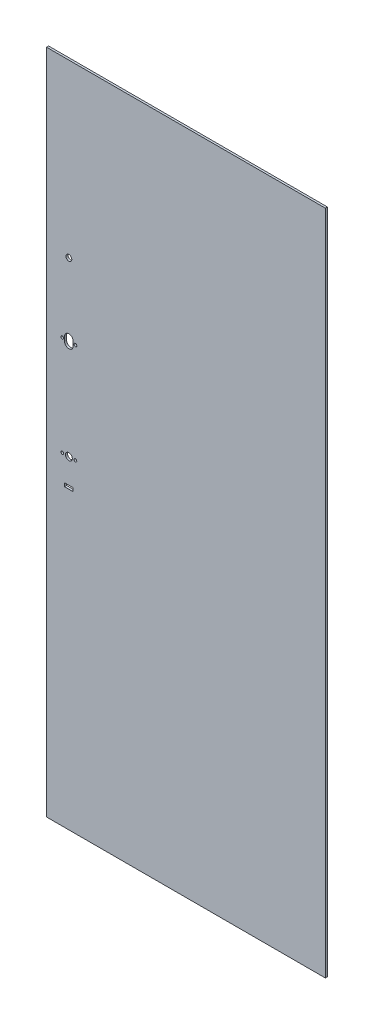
from build123d import *

# Parameters (mm, degrees)
SKETCH_1_W               = 810
SKETCH_1_H               = 1937
EXTRUDE_1_DEPTH          = 6
CUT_EXTRUDE_1_DEPTH      = 1056.077750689
CUT_EXTRUDE_1_DEPTH_BACK = 1056.077750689
SKETCH_2_W               = 25
SKETCH_2_H               = 10
SKETCH_2_R               = 8.5
SKETCH_2_R_2             = 10
SKETCH_2_R_3             = 4
SKETCH_2_R_4             = 4.1


with BuildPart() as part:
    # Sketch 1 → Extrude 1 (new body)
    with BuildSketch(Plane.XY):
        with Locations((0.5, -0.6)):
            Rectangle(SKETCH_1_W, SKETCH_1_H)
    extrude(amount=EXTRUDE_1_DEPTH)

    # Sketch 2 → Cut-Extrude 1 (cut, two sides: drawn at the far end of the back side and taken through both)
    with BuildSketch(Plane(origin=(0, 0, -92), x_dir=(-1, 0, 0), z_dir=(0, 0, -1)).offset(-CUT_EXTRUDE_1_DEPTH_BACK)):
        with Locations((339.7, -106.8)):
            Rectangle(SKETCH_2_W, SKETCH_2_H)
        with BuildLine():
            ThreePointArc((327.2, 254.15), (339.7, 241.65), (352.2, 254.15))
            Line((352.2, 254.15), (352.2, 266.65))
            ThreePointArc((352.2, 266.65), (339.7, 279.15), (327.2, 266.65))
            Line((327.2, 266.65), (327.2, 254.15))
        make_face()
        with Locations(Location((339.7, 470.2, 0), (0, 0, 90))):
            Circle(SKETCH_2_R)
        with Locations(Location((339.7, -29.8, 0), (0, 0, 90))):
            Circle(SKETCH_2_R_2)
        with Locations(Location((358.7, -29.8, 0), (0, 0, 90))):
            Circle(SKETCH_2_R_3)
        with Locations(Location((320.7, -29.8, 0), (0, 0, 90))):
            Circle(SKETCH_2_R_3)
        with Locations(Location((358.7, 260.4, 0), (0, 0, 90))):
            Circle(SKETCH_2_R_4)
        with Locations(Location((320.7, 260.4, 0), (0, 0, 90))):
            Circle(SKETCH_2_R_4)
    extrude(amount=CUT_EXTRUDE_1_DEPTH + CUT_EXTRUDE_1_DEPTH_BACK, mode=Mode.SUBTRACT)


solid = part.part
